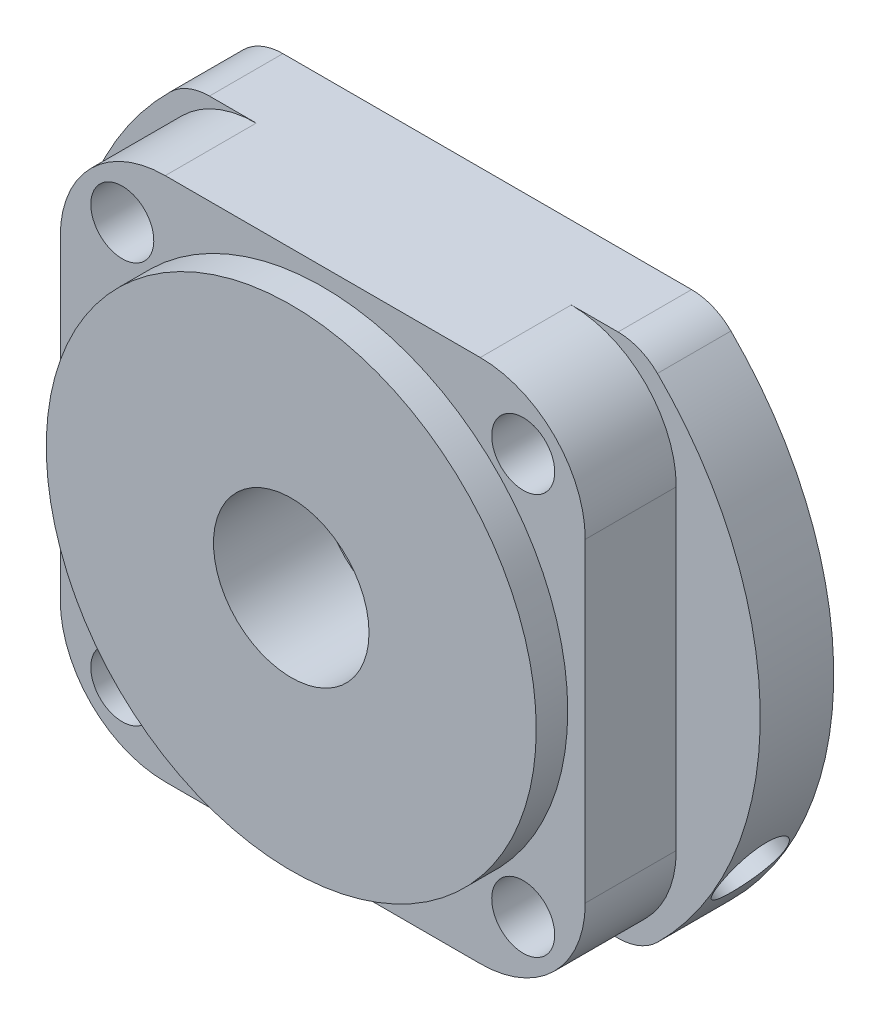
ISO-10303-21;
HEADER;
FILE_DESCRIPTION(('STEP AP214'),'2;1');
FILE_NAME('part.step','',(''),(''),'','','');
FILE_SCHEMA(('AUTOMOTIVE_DESIGN { 1 0 10303 214 1 1 1 1 }'));
ENDSEC;
DATA;
#1=APPLICATION_CONTEXT('core data for automotive mechanical design processes');
#2=APPLICATION_PROTOCOL_DEFINITION('international standard','automotive_design',2000,#1);
#3=PRODUCT_CONTEXT('',#1,'mechanical');
#4=PRODUCT('Part','Part','',(#3));
#5=PRODUCT_RELATED_PRODUCT_CATEGORY('part','',(#4));
#6=PRODUCT_DEFINITION_FORMATION('','',#4);
#7=PRODUCT_DEFINITION_CONTEXT('part definition',#1,'design');
#8=PRODUCT_DEFINITION('design','',#6,#7);
#9=PRODUCT_DEFINITION_SHAPE('','',#8);
#10=(LENGTH_UNIT() NAMED_UNIT(*) SI_UNIT(.MILLI.,.METRE.));
#11=(NAMED_UNIT(*) PLANE_ANGLE_UNIT() SI_UNIT($,.RADIAN.));
#12=(NAMED_UNIT(*) SI_UNIT($,.STERADIAN.) SOLID_ANGLE_UNIT());
#13=UNCERTAINTY_MEASURE_WITH_UNIT(LENGTH_MEASURE(1.E-05),#10,'distance_accuracy_value','');
#14=(GEOMETRIC_REPRESENTATION_CONTEXT(3) GLOBAL_UNCERTAINTY_ASSIGNED_CONTEXT((#13)) GLOBAL_UNIT_ASSIGNED_CONTEXT((#10,
#11,#12)) REPRESENTATION_CONTEXT('',''));
#15=CARTESIAN_POINT('',(0.,0.,0.));
#16=DIRECTION('',(0.,0.,1.));
#17=DIRECTION('',(1.,0.,0.));
#18=AXIS2_PLACEMENT_3D('',#15,#16,#17);
#19=CARTESIAN_POINT('',(0.,0.,21.));
#20=DIRECTION('',(0.,0.,-1.));
#21=DIRECTION('',(-1.,0.,0.));
#22=AXIS2_PLACEMENT_3D('',#19,#20,#21);
#23=CYLINDRICAL_SURFACE('',#22,99.);
#24=CARTESIAN_POINT('',(0.,0.,0.));
#25=DIRECTION('',(0.,0.,1.));
#26=DIRECTION('',(1.,0.,0.));
#27=AXIS2_PLACEMENT_3D('',#24,#25,#26);
#28=CIRCLE('',#27,99.);
#29=CARTESIAN_POINT('',(69.6316834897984,-70.3734939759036,0.));
#30=VERTEX_POINT('',#29);
#31=CARTESIAN_POINT('',(69.6316834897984,70.3734939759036,0.));
#32=VERTEX_POINT('',#31);
#33=EDGE_CURVE('E215',#30,#32,#28,.T.);
#34=ORIENTED_EDGE('',*,*,#33,.T.);
#35=DIRECTION('',(0.,0.,-1.));
#36=VECTOR('',#35,1.);
#37=CARTESIAN_POINT('',(69.6316834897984,70.3734939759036,21.));
#38=LINE('',#37,#36);
#39=CARTESIAN_POINT('',(69.6316834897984,70.3734939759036,21.));
#40=VERTEX_POINT('',#39);
#41=EDGE_CURVE('E237',#32,#40,#38,.F.);
#42=ORIENTED_EDGE('',*,*,#41,.T.);
#43=CARTESIAN_POINT('',(0.,0.,21.));
#44=DIRECTION('',(0.,0.,1.));
#45=DIRECTION('',(1.,0.,0.));
#46=AXIS2_PLACEMENT_3D('',#43,#44,#45);
#47=CIRCLE('',#46,99.);
#48=CARTESIAN_POINT('',(69.6316834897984,-70.3734939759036,21.));
#49=VERTEX_POINT('',#48);
#50=EDGE_CURVE('E204',#49,#40,#47,.T.);
#51=ORIENTED_EDGE('',*,*,#50,.F.);
#52=DIRECTION('',(0.,0.,-1.));
#53=VECTOR('',#52,1.);
#54=CARTESIAN_POINT('',(69.6316834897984,-70.3734939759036,21.));
#55=LINE('',#54,#53);
#56=EDGE_CURVE('E234',#49,#30,#55,.T.);
#57=ORIENTED_EDGE('',*,*,#56,.T.);
#58=EDGE_LOOP('',(#34,#42,#51,#57));
#59=FACE_BOUND('',#58,.T.);
#60=CARTESIAN_POINT('',(80.298007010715,-57.9070813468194,10.5));
#61=CARTESIAN_POINT('',(80.2980049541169,-57.9070833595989,10.2198183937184));
#62=CARTESIAN_POINT('',(80.3049343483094,-57.8974788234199,9.93967902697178));
#63=CARTESIAN_POINT('',(80.3325772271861,-57.8591187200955,9.38130883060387));
#64=CARTESIAN_POINT('',(80.3532940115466,-57.8303585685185,9.10307847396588));
#65=CARTESIAN_POINT('',(80.4083262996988,-57.7538161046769,8.55033629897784));
#66=CARTESIAN_POINT('',(80.4426549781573,-57.7060153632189,8.27582835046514));
#67=CARTESIAN_POINT('',(80.5245518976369,-57.5916789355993,7.73274688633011));
#68=CARTESIAN_POINT('',(80.5721203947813,-57.525142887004,7.46417348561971));
#69=CARTESIAN_POINT('',(80.6799706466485,-57.3737828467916,6.93503817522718));
#70=CARTESIAN_POINT('',(80.740244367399,-57.2889704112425,6.67447132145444));
#71=CARTESIAN_POINT('',(80.8729095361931,-57.1015383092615,6.16300278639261));
#72=CARTESIAN_POINT('',(80.9453011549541,-56.9989183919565,5.91210124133));
#73=CARTESIAN_POINT('',(81.1014588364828,-56.7765076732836,5.42177787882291));
#74=CARTESIAN_POINT('',(81.1852224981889,-56.6567204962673,5.18235365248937));
#75=CARTESIAN_POINT('',(81.3633110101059,-56.4006731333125,4.71659914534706));
#76=CARTESIAN_POINT('',(81.4576359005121,-56.2644128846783,4.49026891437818));
#77=CARTESIAN_POINT('',(81.6562624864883,-55.9757588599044,4.05155706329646));
#78=CARTESIAN_POINT('',(81.7605960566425,-55.823313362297,3.83922390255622));
#79=CARTESIAN_POINT('',(81.9779820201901,-55.5035838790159,3.43081427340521));
#80=CARTESIAN_POINT('',(82.091034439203,-55.3362998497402,3.23473785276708));
#81=CARTESIAN_POINT('',(82.324808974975,-54.9879061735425,2.86020877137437));
#82=CARTESIAN_POINT('',(82.4455315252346,-54.8067957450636,2.68175710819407));
#83=CARTESIAN_POINT('',(82.6935342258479,-54.4318831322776,2.34375280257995));
#84=CARTESIAN_POINT('',(82.8208142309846,-54.2380812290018,2.18419974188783));
#85=CARTESIAN_POINT('',(83.0810772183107,-53.8385694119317,1.8847971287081));
#86=CARTESIAN_POINT('',(83.2140719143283,-53.6328347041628,1.74499083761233));
#87=CARTESIAN_POINT('',(83.4843400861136,-53.2111610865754,1.48649493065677));
#88=CARTESIAN_POINT('',(83.6216135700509,-52.9952221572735,1.36780535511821));
#89=CARTESIAN_POINT('',(83.8992608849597,-52.5545605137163,1.15240428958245));
#90=CARTESIAN_POINT('',(84.039634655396,-52.3298379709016,1.05569237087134));
#91=CARTESIAN_POINT('',(84.322314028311,-51.8731093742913,0.884949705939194));
#92=CARTESIAN_POINT('',(84.4646196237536,-51.64110334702,0.810918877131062));
#93=CARTESIAN_POINT('',(84.7495197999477,-51.1721984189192,0.686296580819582));
#94=CARTESIAN_POINT('',(84.8921117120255,-50.9353190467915,0.635625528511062));
#95=CARTESIAN_POINT('',(85.1769584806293,-50.4575375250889,0.557721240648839));
#96=CARTESIAN_POINT('',(85.3192133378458,-50.2166353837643,0.530487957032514));
#97=CARTESIAN_POINT('',(85.6023138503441,-49.7325094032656,0.499660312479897));
#98=CARTESIAN_POINT('',(85.7431595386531,-49.4892856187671,0.496065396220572));
#99=CARTESIAN_POINT('',(86.0224289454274,-49.0022501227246,0.512539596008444));
#100=CARTESIAN_POINT('',(86.160852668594,-48.758438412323,0.532608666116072));
#101=CARTESIAN_POINT('',(86.4338242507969,-48.2728838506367,0.596146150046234));
#102=CARTESIAN_POINT('',(86.5683844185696,-48.0311366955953,0.639528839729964));
#103=CARTESIAN_POINT('',(86.8332777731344,-47.5505746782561,0.749321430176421));
#104=CARTESIAN_POINT('',(86.9636109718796,-47.3117598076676,0.815731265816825));
#105=CARTESIAN_POINT('',(87.2192496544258,-46.8388167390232,0.971096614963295));
#106=CARTESIAN_POINT('',(87.3445550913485,-46.6046885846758,1.06005233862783));
#107=CARTESIAN_POINT('',(87.5894111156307,-46.1428583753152,1.25986779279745));
#108=CARTESIAN_POINT('',(87.7089616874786,-45.9151563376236,1.37072758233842));
#109=CARTESIAN_POINT('',(87.9418663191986,-45.4674821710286,1.61377529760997));
#110=CARTESIAN_POINT('',(88.0552089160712,-45.2475245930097,1.74600100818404));
#111=CARTESIAN_POINT('',(88.2748888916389,-44.8174331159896,2.03069720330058));
#112=CARTESIAN_POINT('',(88.3812262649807,-44.6072992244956,2.18316770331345));
#113=CARTESIAN_POINT('',(88.5863933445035,-44.1984528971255,2.50728013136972));
#114=CARTESIAN_POINT('',(88.6852228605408,-43.9997407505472,2.67892254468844));
#115=CARTESIAN_POINT('',(88.8749342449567,-43.6152728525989,3.04017063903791));
#116=CARTESIAN_POINT('',(88.9658160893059,-43.4295171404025,3.22977637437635));
#117=CARTESIAN_POINT('',(89.1396453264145,-43.0716077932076,3.62651155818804));
#118=CARTESIAN_POINT('',(89.2225554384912,-42.8995186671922,3.83371554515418));
#119=CARTESIAN_POINT('',(89.3796568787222,-42.5712351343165,4.2634541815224));
#120=CARTESIAN_POINT('',(89.4538481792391,-42.4150407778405,4.48598887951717));
#121=CARTESIAN_POINT('',(89.5932422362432,-42.1198006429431,4.94482525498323));
#122=CARTESIAN_POINT('',(89.6584449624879,-41.980754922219,5.18112697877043));
#123=CARTESIAN_POINT('',(89.7796380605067,-41.7209437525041,5.66583278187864));
#124=CARTESIAN_POINT('',(89.835628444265,-41.6001782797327,5.91423684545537));
#125=CARTESIAN_POINT('',(89.9382264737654,-41.3778976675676,6.4214496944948));
#126=CARTESIAN_POINT('',(89.9848320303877,-41.2763868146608,6.68026078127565));
#127=CARTESIAN_POINT('',(90.0685000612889,-41.0934960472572,7.20639937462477));
#128=CARTESIAN_POINT('',(90.105562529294,-41.0121161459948,7.47372688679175));
#129=CARTESIAN_POINT('',(90.1700325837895,-40.8701762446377,8.01498501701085));
#130=CARTESIAN_POINT('',(90.1974404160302,-40.809615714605,8.28891546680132));
#131=CARTESIAN_POINT('',(90.2425226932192,-40.7098280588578,8.84142344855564));
#132=CARTESIAN_POINT('',(90.2601971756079,-40.6706008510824,9.12000096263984));
#133=CARTESIAN_POINT('',(90.2857060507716,-40.6139415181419,9.67856467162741));
#134=CARTESIAN_POINT('',(90.2935835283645,-40.5964139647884,9.95853922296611));
#135=CARTESIAN_POINT('',(90.2996190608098,-40.582987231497,10.519110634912));
#136=CARTESIAN_POINT('',(90.2977771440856,-40.5870879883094,10.7997074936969));
#137=CARTESIAN_POINT('',(90.2843791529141,-40.6168825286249,11.3595154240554));
#138=CARTESIAN_POINT('',(90.2728232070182,-40.6425760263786,11.6387265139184));
#139=CARTESIAN_POINT('',(90.2400297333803,-40.7153364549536,12.1937744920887));
#140=CARTESIAN_POINT('',(90.2187922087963,-40.7624033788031,12.4696113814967));
#141=CARTESIAN_POINT('',(90.1667521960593,-40.877386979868,13.0153591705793));
#142=CARTESIAN_POINT('',(90.1359704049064,-40.9452585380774,13.2852815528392));
#143=CARTESIAN_POINT('',(90.0649164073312,-41.1013159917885,13.8179069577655));
#144=CARTESIAN_POINT('',(90.0246442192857,-41.1895018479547,14.0806099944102));
#145=CARTESIAN_POINT('',(89.9347290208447,-41.3854579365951,14.596956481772));
#146=CARTESIAN_POINT('',(89.885085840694,-41.4932285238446,14.8505997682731));
#147=CARTESIAN_POINT('',(89.7765835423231,-41.7274693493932,15.3470489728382));
#148=CARTESIAN_POINT('',(89.7177243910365,-41.8539396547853,15.5898548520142));
#149=CARTESIAN_POINT('',(89.5907619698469,-42.1250262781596,16.063760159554));
#150=CARTESIAN_POINT('',(89.5226272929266,-42.269704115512,16.2948159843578));
#151=CARTESIAN_POINT('',(89.3775080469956,-42.5756939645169,16.7426955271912));
#152=CARTESIAN_POINT('',(89.3005234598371,-42.7370060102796,16.9595192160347));
#153=CARTESIAN_POINT('',(89.1379870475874,-43.0749859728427,17.3774240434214));
#154=CARTESIAN_POINT('',(89.0524350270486,-43.2516542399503,17.5785048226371));
#155=CARTESIAN_POINT('',(88.8731031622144,-43.618955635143,17.9635114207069));
#156=CARTESIAN_POINT('',(88.7793233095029,-43.8095887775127,18.147437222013));
#157=CARTESIAN_POINT('',(88.5835725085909,-44.2040646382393,18.497486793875));
#158=CARTESIAN_POINT('',(88.4815726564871,-44.4079534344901,18.6635424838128));
#159=CARTESIAN_POINT('',(88.2701513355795,-44.8267262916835,18.9758908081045));
#160=CARTESIAN_POINT('',(88.1607298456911,-45.0416103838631,19.1221833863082));
#161=CARTESIAN_POINT('',(87.9350049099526,-45.4807194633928,19.3939562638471));
#162=CARTESIAN_POINT('',(87.8187015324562,-45.7049443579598,19.5194367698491));
#163=CARTESIAN_POINT('',(87.5798257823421,-46.1610265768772,19.7486811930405));
#164=CARTESIAN_POINT('',(87.457253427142,-46.3928838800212,19.8524451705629));
#165=CARTESIAN_POINT('',(87.2067598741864,-46.8620487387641,20.0373330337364));
#166=CARTESIAN_POINT('',(87.0788488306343,-47.0993455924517,20.1184978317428));
#167=CARTESIAN_POINT('',(86.8182357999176,-47.57802212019,20.2578448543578));
#168=CARTESIAN_POINT('',(86.6855338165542,-47.8194017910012,20.3160270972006));
#169=CARTESIAN_POINT('',(86.4161852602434,-48.3044498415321,20.408979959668));
#170=CARTESIAN_POINT('',(86.279538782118,-48.5481181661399,20.4437511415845));
#171=CARTESIAN_POINT('',(86.0032145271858,-49.0359630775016,20.4896270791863));
#172=CARTESIAN_POINT('',(85.8635367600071,-49.280139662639,20.5007319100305));
#173=CARTESIAN_POINT('',(85.5827604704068,-49.7661483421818,20.49919669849));
#174=CARTESIAN_POINT('',(85.4416710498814,-50.0079860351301,20.4866622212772));
#175=CARTESIAN_POINT('',(85.1584907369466,-50.4887044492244,20.4381483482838));
#176=CARTESIAN_POINT('',(85.0163998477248,-50.7275851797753,20.4021690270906));
#177=CARTESIAN_POINT('',(84.7322930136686,-51.2007291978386,20.3070290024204));
#178=CARTESIAN_POINT('',(84.5902770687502,-51.434992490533,20.2478683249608));
#179=CARTESIAN_POINT('',(84.3074334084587,-51.8973035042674,20.1067966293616));
#180=CARTESIAN_POINT('',(84.1666056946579,-52.1253512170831,20.0248855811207));
#181=CARTESIAN_POINT('',(83.8872982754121,-52.5736715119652,19.8389199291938));
#182=CARTESIAN_POINT('',(83.7488182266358,-52.7939452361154,19.734868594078));
#183=CARTESIAN_POINT('',(83.4753360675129,-53.2253087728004,19.5053625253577));
#184=CARTESIAN_POINT('',(83.3403339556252,-53.4363985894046,19.3799078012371));
#185=CARTESIAN_POINT('',(83.0749601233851,-53.8480359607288,19.1084898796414));
#186=CARTESIAN_POINT('',(82.9445883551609,-54.0485836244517,18.9625268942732));
#187=CARTESIAN_POINT('',(82.6896119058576,-54.4378749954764,18.6511227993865));
#188=CARTESIAN_POINT('',(82.5650072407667,-54.6266186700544,18.485681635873));
#189=CARTESIAN_POINT('',(82.3221600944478,-54.9919110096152,18.1357358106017));
#190=CARTESIAN_POINT('',(82.2039470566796,-55.1684041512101,17.9511527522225));
#191=CARTESIAN_POINT('',(81.9755457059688,-55.5072216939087,17.5648078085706));
#192=CARTESIAN_POINT('',(81.8653575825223,-55.6695457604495,17.3630455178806));
#193=CARTESIAN_POINT('',(81.6540200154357,-55.9790688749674,16.9437115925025));
#194=CARTESIAN_POINT('',(81.5528727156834,-56.1262643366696,16.7261362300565));
#195=CARTESIAN_POINT('',(81.3606189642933,-56.4045946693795,16.2767475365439));
#196=CARTESIAN_POINT('',(81.2695123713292,-56.5357297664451,16.0449344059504));
#197=CARTESIAN_POINT('',(81.0980067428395,-56.7814742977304,15.5680704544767));
#198=CARTESIAN_POINT('',(81.0176363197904,-56.8960396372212,15.3229866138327));
#199=CARTESIAN_POINT('',(80.86869251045,-57.1075416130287,14.8218791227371));
#200=CARTESIAN_POINT('',(80.8001188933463,-57.2044785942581,14.5658556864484));
#201=CARTESIAN_POINT('',(80.675528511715,-57.3800548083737,14.0449348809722));
#202=CARTESIAN_POINT('',(80.6194993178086,-57.4587121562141,13.7800465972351));
#203=CARTESIAN_POINT('',(80.5205040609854,-57.5973581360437,13.2431357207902));
#204=CARTESIAN_POINT('',(80.4775347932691,-57.6573513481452,12.9711148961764));
#205=CARTESIAN_POINT('',(80.393841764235,-57.7740162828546,12.3364510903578));
#206=CARTESIAN_POINT('',(80.3579548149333,-57.8238770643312,11.971887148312));
#207=CARTESIAN_POINT('',(80.3100388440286,-57.8904081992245,11.2381910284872));
#208=CARTESIAN_POINT('',(80.2980097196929,-57.90707869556,10.869058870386));
#209=CARTESIAN_POINT('',(80.298007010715,-57.9070813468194,10.5));
#210=B_SPLINE_CURVE_WITH_KNOTS('',3,(#60,#61,#62,#63,#64,#65,#66,#67,#68,#69,#70,#71,#72,#73,
#74,#75,#76,#77,#78,#79,#80,#81,#82,#83,#84,#85,#86,#87,#88,#89,#90,#91,#92,#93,#94,#95,#96,#97,
#98,#99,#100,#101,#102,#103,#104,#105,#106,#107,#108,#109,#110,#111,#112,#113,#114,#115,#116,
#117,#118,#119,#120,#121,#122,#123,#124,#125,#126,#127,#128,#129,#130,#131,#132,#133,#134,#135,
#136,#137,#138,#139,#140,#141,#142,#143,#144,#145,#146,#147,#148,#149,#150,#151,#152,#153,#154,
#155,#156,#157,#158,#159,#160,#161,#162,#163,#164,#165,#166,#167,#168,#169,#170,#171,#172,#173,
#174,#175,#176,#177,#178,#179,#180,#181,#182,#183,#184,#185,#186,#187,#188,#189,#190,#191,#192,
#193,#194,#195,#196,#197,#198,#199,#200,#201,#202,#203,#204,#205,#206,#207,#208,#209),
.UNSPECIFIED.,.T.,.F.,(4,2,2,2,2,2,2,2,2,2,2,2,2,2,2,2,2,2,2,2,2,2,2,2,2,2,2,2,2,2,2,2,2,2,2,2,
2,2,2,2,2,2,2,2,2,2,2,2,2,2,2,2,2,2,2,2,2,2,2,2,2,2,2,2,2,2,2,2,2,2,2,2,2,2,4),(0.,
0.840222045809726,1.68064525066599,2.52188387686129,3.36313877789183,4.20386331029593,
5.0445996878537,5.88515882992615,6.72572117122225,7.56905542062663,8.41239214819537,
9.25577658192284,10.0991423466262,10.9443280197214,11.7895153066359,12.6346861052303,
13.4798538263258,14.3221204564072,15.1643853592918,16.0066304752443,16.848873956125,
17.6880414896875,18.5272066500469,19.3663796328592,20.2055548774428,21.0462307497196,
21.8869072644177,22.7276050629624,23.5683054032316,24.4127634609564,25.2572241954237,
26.101687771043,26.9461502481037,27.7908005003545,28.6354513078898,29.4800806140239,
30.3247066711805,31.1656049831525,32.006500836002,32.8473855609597,33.6882700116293,
34.5273435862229,35.3664155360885,36.2055026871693,37.0445928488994,37.8865983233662,
38.728605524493,39.5706319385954,40.4126592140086,41.2577885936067,42.1029203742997,
42.9480437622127,43.7931648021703,44.6367457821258,45.480326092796,46.3238861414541,
47.1674435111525,48.0072427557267,48.8470393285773,49.6868349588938,50.5266317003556,
51.366304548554,52.2059770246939,53.0456408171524,53.8853069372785,54.7285590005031,
55.5718309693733,56.415302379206,57.2587619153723,58.1044262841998,58.9500741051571,
59.7948802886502,60.6394789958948,61.7462352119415,62.8529866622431),.UNSPECIFIED.);
#211=CARTESIAN_POINT('',(80.298007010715,-57.9070813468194,10.5));
#212=VERTEX_POINT('',#211);
#213=EDGE_CURVE('E44',#212,#212,#210,.T.);
#214=ORIENTED_EDGE('',*,*,#213,.F.);
#215=EDGE_LOOP('',(#214));
#216=FACE_BOUND('',#215,.T.);
#217=ADVANCED_FACE('F40',(#59,#216),#23,.T.);
#218=CARTESIAN_POINT('',(-45.,45.,47.));
#219=DIRECTION('',(0.,0.,1.));
#220=DIRECTION('',(1.,0.,0.));
#221=AXIS2_PLACEMENT_3D('',#218,#219,#220);
#222=PLANE('',#221);
#223=CARTESIAN_POINT('',(-57.2756492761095,57.2756492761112,47.));
#224=DIRECTION('',(0.,0.,1.));
#225=DIRECTION('',(0.,1.,0.));
#226=AXIS2_PLACEMENT_3D('',#223,#224,#225);
#227=CIRCLE('',#226,9.00000000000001);
#228=CARTESIAN_POINT('',(-57.2756492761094,66.2756492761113,47.));
#229=VERTEX_POINT('',#228);
#230=EDGE_CURVE('E408',#229,#229,#227,.T.);
#231=ORIENTED_EDGE('',*,*,#230,.F.);
#232=EDGE_LOOP('',(#231));
#233=FACE_BOUND('',#232,.T.);
#234=CARTESIAN_POINT('',(-57.275649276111,-57.2756492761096,47.));
#235=DIRECTION('',(0.,0.,1.));
#236=DIRECTION('',(-1.,0.,0.));
#237=AXIS2_PLACEMENT_3D('',#234,#235,#236);
#238=CIRCLE('',#237,9.00000000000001);
#239=CARTESIAN_POINT('',(-66.2756492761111,-57.2756492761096,47.));
#240=VERTEX_POINT('',#239);
#241=EDGE_CURVE('E402',#240,#240,#238,.T.);
#242=ORIENTED_EDGE('',*,*,#241,.F.);
#243=EDGE_LOOP('',(#242));
#244=FACE_BOUND('',#243,.T.);
#245=CARTESIAN_POINT('',(57.2756492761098,-57.2756492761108,47.));
#246=DIRECTION('',(0.,0.,1.));
#247=DIRECTION('',(0.,-1.,0.));
#248=AXIS2_PLACEMENT_3D('',#245,#246,#247);
#249=CIRCLE('',#248,9.00000000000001);
#250=CARTESIAN_POINT('',(57.2756492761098,-66.2756492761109,47.));
#251=VERTEX_POINT('',#250);
#252=EDGE_CURVE('E394',#251,#251,#249,.T.);
#253=ORIENTED_EDGE('',*,*,#252,.F.);
#254=EDGE_LOOP('',(#253));
#255=FACE_BOUND('',#254,.T.);
#256=CARTESIAN_POINT('',(57.2756492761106,57.2756492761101,47.));
#257=DIRECTION('',(0.,0.,1.));
#258=DIRECTION('',(1.,0.,0.));
#259=AXIS2_PLACEMENT_3D('',#256,#257,#258);
#260=CIRCLE('',#259,9.00000000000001);
#261=CARTESIAN_POINT('',(66.2756492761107,57.2756492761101,47.));
#262=VERTEX_POINT('',#261);
#263=EDGE_CURVE('E262',#262,#262,#260,.T.);
#264=ORIENTED_EDGE('',*,*,#263,.F.);
#265=EDGE_LOOP('',(#264));
#266=FACE_BOUND('',#265,.T.);
#267=CARTESIAN_POINT('',(-45.,45.,47.));
#268=DIRECTION('',(0.,0.,1.));
#269=DIRECTION('',(1.,0.,0.));
#270=AXIS2_PLACEMENT_3D('',#267,#268,#269);
#271=CIRCLE('',#270,30.);
#272=CARTESIAN_POINT('',(-45.,75.,47.));
#273=VERTEX_POINT('',#272);
#274=CARTESIAN_POINT('',(-75.,45.,47.));
#275=VERTEX_POINT('',#274);
#276=EDGE_CURVE('E168',#273,#275,#271,.T.);
#277=ORIENTED_EDGE('',*,*,#276,.T.);
#278=DIRECTION('',(0.,-1.,0.));
#279=VECTOR('',#278,1.);
#280=CARTESIAN_POINT('',(-75.,45.,47.));
#281=LINE('',#280,#279);
#282=CARTESIAN_POINT('',(-75.,-45.,47.));
#283=VERTEX_POINT('',#282);
#284=EDGE_CURVE('E158',#275,#283,#281,.T.);
#285=ORIENTED_EDGE('',*,*,#284,.T.);
#286=CARTESIAN_POINT('',(-45.,-45.,47.));
#287=DIRECTION('',(0.,0.,1.));
#288=DIRECTION('',(1.,0.,0.));
#289=AXIS2_PLACEMENT_3D('',#286,#287,#288);
#290=CIRCLE('',#289,30.);
#291=CARTESIAN_POINT('',(-45.,-75.,47.));
#292=VERTEX_POINT('',#291);
#293=EDGE_CURVE('E167',#283,#292,#290,.T.);
#294=ORIENTED_EDGE('',*,*,#293,.T.);
#295=DIRECTION('',(1.,0.,0.));
#296=VECTOR('',#295,1.);
#297=CARTESIAN_POINT('',(-45.,-75.,47.));
#298=LINE('',#297,#296);
#299=CARTESIAN_POINT('',(45.,-75.,47.));
#300=VERTEX_POINT('',#299);
#301=EDGE_CURVE('E267',#292,#300,#298,.T.);
#302=ORIENTED_EDGE('',*,*,#301,.T.);
#303=CARTESIAN_POINT('',(45.,-45.,47.));
#304=DIRECTION('',(0.,0.,1.));
#305=DIRECTION('',(1.,0.,0.));
#306=AXIS2_PLACEMENT_3D('',#303,#304,#305);
#307=CIRCLE('',#306,30.);
#308=CARTESIAN_POINT('',(75.,-45.,47.));
#309=VERTEX_POINT('',#308);
#310=EDGE_CURVE('E269',#300,#309,#307,.T.);
#311=ORIENTED_EDGE('',*,*,#310,.T.);
#312=DIRECTION('',(0.,1.,0.));
#313=VECTOR('',#312,1.);
#314=CARTESIAN_POINT('',(75.,45.,47.));
#315=LINE('',#314,#313);
#316=CARTESIAN_POINT('',(75.,45.,47.));
#317=VERTEX_POINT('',#316);
#318=EDGE_CURVE('E271',#309,#317,#315,.T.);
#319=ORIENTED_EDGE('',*,*,#318,.T.);
#320=CARTESIAN_POINT('',(45.,45.,47.));
#321=DIRECTION('',(0.,0.,1.));
#322=DIRECTION('',(-1.,0.,0.));
#323=AXIS2_PLACEMENT_3D('',#320,#321,#322);
#324=CIRCLE('',#323,30.);
#325=CARTESIAN_POINT('',(45.,75.,47.));
#326=VERTEX_POINT('',#325);
#327=EDGE_CURVE('E273',#317,#326,#324,.T.);
#328=ORIENTED_EDGE('',*,*,#327,.T.);
#329=DIRECTION('',(-1.,0.,0.));
#330=VECTOR('',#329,1.);
#331=CARTESIAN_POINT('',(-45.,75.,47.));
#332=LINE('',#331,#330);
#333=EDGE_CURVE('E174',#326,#273,#332,.T.);
#334=ORIENTED_EDGE('',*,*,#333,.T.);
#335=EDGE_LOOP('',(#277,#285,#294,#302,#311,#319,#328,#334));
#336=FACE_BOUND('',#335,.T.);
#337=CARTESIAN_POINT('',(0.,0.,47.));
#338=DIRECTION('',(0.,0.,1.));
#339=DIRECTION('',(1.,0.,0.));
#340=AXIS2_PLACEMENT_3D('',#337,#338,#339);
#341=CIRCLE('',#340,70.);
#342=CARTESIAN_POINT('',(70.,0.,47.));
#343=VERTEX_POINT('',#342);
#344=EDGE_CURVE('E178',#343,#343,#341,.F.);
#345=ORIENTED_EDGE('',*,*,#344,.T.);
#346=EDGE_LOOP('',(#345));
#347=FACE_BOUND('',#346,.T.);
#348=ADVANCED_FACE('F171',(#233,#244,#255,#266,#336,#347),#222,.T.);
#349=CARTESIAN_POINT('',(0.,0.,21.));
#350=DIRECTION('',(0.,0.,1.));
#351=DIRECTION('',(1.,0.,0.));
#352=AXIS2_PLACEMENT_3D('',#349,#350,#351);
#353=PLANE('',#352);
#354=DIRECTION('',(0.,1.,0.));
#355=VECTOR('',#354,1.);
#356=CARTESIAN_POINT('',(-75.,0.,21.));
#357=LINE('',#356,#355);
#358=CARTESIAN_POINT('',(-75.,-45.,21.));
#359=VERTEX_POINT('',#358);
#360=CARTESIAN_POINT('',(-75.,45.,21.));
#361=VERTEX_POINT('',#360);
#362=EDGE_CURVE('E61',#359,#361,#357,.T.);
#363=ORIENTED_EDGE('',*,*,#362,.T.);
#364=CARTESIAN_POINT('',(-45.,45.,21.));
#365=DIRECTION('',(0.,0.,1.));
#366=DIRECTION('',(1.,0.,0.));
#367=AXIS2_PLACEMENT_3D('',#364,#365,#366);
#368=CIRCLE('',#367,30.);
#369=CARTESIAN_POINT('',(-45.,75.,21.));
#370=VERTEX_POINT('',#369);
#371=EDGE_CURVE('E181',#361,#370,#368,.F.);
#372=ORIENTED_EDGE('',*,*,#371,.T.);
#373=DIRECTION('',(-1.,0.,0.));
#374=VECTOR('',#373,1.);
#375=CARTESIAN_POINT('',(-64.6219776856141,75.,21.));
#376=LINE('',#375,#374);
#377=CARTESIAN_POINT('',(-58.3780780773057,75.,21.));
#378=VERTEX_POINT('',#377);
#379=EDGE_CURVE('E207',#370,#378,#376,.T.);
#380=ORIENTED_EDGE('',*,*,#379,.T.);
#381=CARTESIAN_POINT('',(-58.3780780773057,59.,21.));
#382=DIRECTION('',(0.,0.,1.));
#383=DIRECTION('',(1.,0.,0.));
#384=AXIS2_PLACEMENT_3D('',#381,#382,#383);
#385=CIRCLE('',#384,16.);
#386=CARTESIAN_POINT('',(-69.6316834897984,70.3734939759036,21.));
#387=VERTEX_POINT('',#386);
#388=EDGE_CURVE('E243',#378,#387,#385,.T.);
#389=ORIENTED_EDGE('',*,*,#388,.T.);
#390=CARTESIAN_POINT('',(0.,0.,21.));
#391=DIRECTION('',(0.,0.,1.));
#392=DIRECTION('',(1.,0.,0.));
#393=AXIS2_PLACEMENT_3D('',#390,#391,#392);
#394=CIRCLE('',#393,99.);
#395=CARTESIAN_POINT('',(-69.6316834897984,-70.3734939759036,21.));
#396=VERTEX_POINT('',#395);
#397=EDGE_CURVE('E197',#387,#396,#394,.T.);
#398=ORIENTED_EDGE('',*,*,#397,.T.);
#399=CARTESIAN_POINT('',(-58.3780780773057,-59.,21.));
#400=DIRECTION('',(0.,0.,1.));
#401=DIRECTION('',(1.,0.,0.));
#402=AXIS2_PLACEMENT_3D('',#399,#400,#401);
#403=CIRCLE('',#402,16.);
#404=CARTESIAN_POINT('',(-58.3780780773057,-75.,21.));
#405=VERTEX_POINT('',#404);
#406=EDGE_CURVE('E239',#396,#405,#403,.T.);
#407=ORIENTED_EDGE('',*,*,#406,.T.);
#408=DIRECTION('',(1.,0.,0.));
#409=VECTOR('',#408,1.);
#410=CARTESIAN_POINT('',(-64.6219776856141,-75.,21.));
#411=LINE('',#410,#409);
#412=CARTESIAN_POINT('',(-45.,-75.,21.));
#413=VERTEX_POINT('',#412);
#414=EDGE_CURVE('E202',#405,#413,#411,.T.);
#415=ORIENTED_EDGE('',*,*,#414,.T.);
#416=CARTESIAN_POINT('',(-45.,-45.,21.));
#417=DIRECTION('',(0.,0.,1.));
#418=DIRECTION('',(1.,0.,0.));
#419=AXIS2_PLACEMENT_3D('',#416,#417,#418);
#420=CIRCLE('',#419,30.);
#421=EDGE_CURVE('E66',#413,#359,#420,.F.);
#422=ORIENTED_EDGE('',*,*,#421,.T.);
#423=EDGE_LOOP('',(#363,#372,#380,#389,#398,#407,#415,#422));
#424=FACE_BOUND('',#423,.T.);
#425=ADVANCED_FACE('F320',(#424),#353,.T.);
#426=DIRECTION('',(0.,-1.,0.));
#427=VECTOR('',#426,1.);
#428=CARTESIAN_POINT('',(75.,0.,21.));
#429=LINE('',#428,#427);
#430=CARTESIAN_POINT('',(75.,45.,21.));
#431=VERTEX_POINT('',#430);
#432=CARTESIAN_POINT('',(75.,-45.,21.));
#433=VERTEX_POINT('',#432);
#434=EDGE_CURVE('E184',#431,#433,#429,.T.);
#435=ORIENTED_EDGE('',*,*,#434,.T.);
#436=CARTESIAN_POINT('',(45.,-45.,21.));
#437=DIRECTION('',(0.,0.,1.));
#438=DIRECTION('',(1.,0.,0.));
#439=AXIS2_PLACEMENT_3D('',#436,#437,#438);
#440=CIRCLE('',#439,30.);
#441=CARTESIAN_POINT('',(45.,-75.,21.));
#442=VERTEX_POINT('',#441);
#443=EDGE_CURVE('E191',#433,#442,#440,.F.);
#444=ORIENTED_EDGE('',*,*,#443,.T.);
#445=CARTESIAN_POINT('',(58.3780780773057,-75.,21.));
#446=VERTEX_POINT('',#445);
#447=EDGE_CURVE('E200',#442,#446,#411,.T.);
#448=ORIENTED_EDGE('',*,*,#447,.T.);
#449=CARTESIAN_POINT('',(58.3780780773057,-59.,21.));
#450=DIRECTION('',(0.,0.,1.));
#451=DIRECTION('',(1.,0.,0.));
#452=AXIS2_PLACEMENT_3D('',#449,#450,#451);
#453=CIRCLE('',#452,16.);
#454=EDGE_CURVE('E241',#446,#49,#453,.T.);
#455=ORIENTED_EDGE('',*,*,#454,.T.);
#456=ORIENTED_EDGE('',*,*,#50,.T.);
#457=CARTESIAN_POINT('',(58.3780780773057,59.,21.));
#458=DIRECTION('',(0.,0.,1.));
#459=DIRECTION('',(1.,0.,0.));
#460=AXIS2_PLACEMENT_3D('',#457,#458,#459);
#461=CIRCLE('',#460,16.);
#462=CARTESIAN_POINT('',(58.3780780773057,75.,21.));
#463=VERTEX_POINT('',#462);
#464=EDGE_CURVE('E245',#40,#463,#461,.T.);
#465=ORIENTED_EDGE('',*,*,#464,.T.);
#466=CARTESIAN_POINT('',(45.,75.,21.));
#467=VERTEX_POINT('',#466);
#468=EDGE_CURVE('E208',#463,#467,#376,.T.);
#469=ORIENTED_EDGE('',*,*,#468,.T.);
#470=CARTESIAN_POINT('',(45.,45.,21.));
#471=DIRECTION('',(0.,0.,1.));
#472=DIRECTION('',(1.,0.,0.));
#473=AXIS2_PLACEMENT_3D('',#470,#471,#472);
#474=CIRCLE('',#473,30.);
#475=EDGE_CURVE('E182',#467,#431,#474,.F.);
#476=ORIENTED_EDGE('',*,*,#475,.T.);
#477=EDGE_LOOP('',(#435,#444,#448,#455,#456,#465,#469,#476));
#478=FACE_BOUND('',#477,.T.);
#479=ADVANCED_FACE('F322',(#478),#353,.T.);
#480=CARTESIAN_POINT('',(0.,0.,21.));
#481=DIRECTION('',(0.,0.,-1.));
#482=DIRECTION('',(-1.,0.,0.));
#483=AXIS2_PLACEMENT_3D('',#480,#481,#482);
#484=CYLINDRICAL_SURFACE('',#483,99.);
#485=ORIENTED_EDGE('',*,*,#397,.F.);
#486=DIRECTION('',(0.,0.,-1.));
#487=VECTOR('',#486,1.);
#488=CARTESIAN_POINT('',(-69.6316834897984,70.3734939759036,21.));
#489=LINE('',#488,#487);
#490=CARTESIAN_POINT('',(-69.6316834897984,70.3734939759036,0.));
#491=VERTEX_POINT('',#490);
#492=EDGE_CURVE('E249',#387,#491,#489,.T.);
#493=ORIENTED_EDGE('',*,*,#492,.T.);
#494=CARTESIAN_POINT('',(0.,0.,0.));
#495=DIRECTION('',(0.,0.,1.));
#496=DIRECTION('',(1.,0.,0.));
#497=AXIS2_PLACEMENT_3D('',#494,#495,#496);
#498=CIRCLE('',#497,99.);
#499=CARTESIAN_POINT('',(-69.6316834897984,-70.3734939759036,0.));
#500=VERTEX_POINT('',#499);
#501=EDGE_CURVE('E196',#491,#500,#498,.T.);
#502=ORIENTED_EDGE('',*,*,#501,.T.);
#503=DIRECTION('',(0.,0.,-1.));
#504=VECTOR('',#503,1.);
#505=CARTESIAN_POINT('',(-69.6316834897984,-70.3734939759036,21.));
#506=LINE('',#505,#504);
#507=EDGE_CURVE('E247',#500,#396,#506,.F.);
#508=ORIENTED_EDGE('',*,*,#507,.T.);
#509=EDGE_LOOP('',(#485,#493,#502,#508));
#510=FACE_BOUND('',#509,.T.);
#511=ADVANCED_FACE('F328',(#510),#484,.T.);
#512=CARTESIAN_POINT('',(-64.6219776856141,-75.,21.));
#513=DIRECTION('',(0.,1.,0.));
#514=DIRECTION('',(0.,0.,1.));
#515=AXIS2_PLACEMENT_3D('',#512,#513,#514);
#516=PLANE('',#515);
#517=DIRECTION('',(1.,0.,0.));
#518=VECTOR('',#517,1.);
#519=CARTESIAN_POINT('',(-64.6219776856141,-75.,0.));
#520=LINE('',#519,#518);
#521=CARTESIAN_POINT('',(-58.3780780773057,-75.,0.));
#522=VERTEX_POINT('',#521);
#523=CARTESIAN_POINT('',(58.3780780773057,-75.,0.));
#524=VERTEX_POINT('',#523);
#525=EDGE_CURVE('E213',#522,#524,#520,.T.);
#526=ORIENTED_EDGE('',*,*,#525,.T.);
#527=DIRECTION('',(0.,0.,-1.));
#528=VECTOR('',#527,1.);
#529=CARTESIAN_POINT('',(58.3780780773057,-75.,21.));
#530=LINE('',#529,#528);
#531=EDGE_CURVE('E11',#524,#446,#530,.F.);
#532=ORIENTED_EDGE('',*,*,#531,.T.);
#533=ORIENTED_EDGE('',*,*,#447,.F.);
#534=DIRECTION('',(0.,0.,-1.));
#535=VECTOR('',#534,1.);
#536=CARTESIAN_POINT('',(45.,-75.,47.));
#537=LINE('',#536,#535);
#538=EDGE_CURVE('E287',#300,#442,#537,.T.);
#539=ORIENTED_EDGE('',*,*,#538,.F.);
#540=ORIENTED_EDGE('',*,*,#301,.F.);
#541=DIRECTION('',(0.,0.,-1.));
#542=VECTOR('',#541,1.);
#543=CARTESIAN_POINT('',(-45.,-75.,47.));
#544=LINE('',#543,#542);
#545=EDGE_CURVE('E186',#292,#413,#544,.T.);
#546=ORIENTED_EDGE('',*,*,#545,.T.);
#547=ORIENTED_EDGE('',*,*,#414,.F.);
#548=DIRECTION('',(0.,0.,-1.));
#549=VECTOR('',#548,1.);
#550=CARTESIAN_POINT('',(-58.3780780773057,-75.,21.));
#551=LINE('',#550,#549);
#552=EDGE_CURVE('E53',#405,#522,#551,.T.);
#553=ORIENTED_EDGE('',*,*,#552,.T.);
#554=EDGE_LOOP('',(#526,#532,#533,#539,#540,#546,#547,#553));
#555=FACE_BOUND('',#554,.T.);
#556=ADVANCED_FACE('F294',(#555),#516,.F.);
#557=CARTESIAN_POINT('',(-64.6219776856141,75.,21.));
#558=DIRECTION('',(0.,-1.,0.));
#559=DIRECTION('',(0.,0.,-1.));
#560=AXIS2_PLACEMENT_3D('',#557,#558,#559);
#561=PLANE('',#560);
#562=DIRECTION('',(-1.,0.,0.));
#563=VECTOR('',#562,1.);
#564=CARTESIAN_POINT('',(-64.6219776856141,75.,0.));
#565=LINE('',#564,#563);
#566=CARTESIAN_POINT('',(58.3780780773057,75.,0.));
#567=VERTEX_POINT('',#566);
#568=CARTESIAN_POINT('',(-58.3780780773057,75.,0.));
#569=VERTEX_POINT('',#568);
#570=EDGE_CURVE('E201',#567,#569,#565,.T.);
#571=ORIENTED_EDGE('',*,*,#570,.T.);
#572=DIRECTION('',(0.,0.,-1.));
#573=VECTOR('',#572,1.);
#574=CARTESIAN_POINT('',(-58.3780780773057,75.,21.));
#575=LINE('',#574,#573);
#576=EDGE_CURVE('E210',#569,#378,#575,.F.);
#577=ORIENTED_EDGE('',*,*,#576,.T.);
#578=ORIENTED_EDGE('',*,*,#379,.F.);
#579=DIRECTION('',(0.,0.,-1.));
#580=VECTOR('',#579,1.);
#581=CARTESIAN_POINT('',(-45.,75.,47.));
#582=LINE('',#581,#580);
#583=EDGE_CURVE('E276',#273,#370,#582,.T.);
#584=ORIENTED_EDGE('',*,*,#583,.F.);
#585=ORIENTED_EDGE('',*,*,#333,.F.);
#586=DIRECTION('',(0.,0.,-1.));
#587=VECTOR('',#586,1.);
#588=CARTESIAN_POINT('',(45.,75.,47.));
#589=LINE('',#588,#587);
#590=EDGE_CURVE('E278',#326,#467,#589,.T.);
#591=ORIENTED_EDGE('',*,*,#590,.T.);
#592=ORIENTED_EDGE('',*,*,#468,.F.);
#593=DIRECTION('',(0.,0.,-1.));
#594=VECTOR('',#593,1.);
#595=CARTESIAN_POINT('',(58.3780780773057,75.,21.));
#596=LINE('',#595,#594);
#597=EDGE_CURVE('E221',#463,#567,#596,.T.);
#598=ORIENTED_EDGE('',*,*,#597,.T.);
#599=EDGE_LOOP('',(#571,#577,#578,#584,#585,#591,#592,#598));
#600=FACE_BOUND('',#599,.T.);
#601=ADVANCED_FACE('F317',(#600),#561,.F.);
#602=CARTESIAN_POINT('',(0.,0.,0.));
#603=DIRECTION('',(0.,0.,1.));
#604=DIRECTION('',(1.,0.,0.));
#605=AXIS2_PLACEMENT_3D('',#602,#603,#604);
#606=PLANE('',#605);
#607=CARTESIAN_POINT('',(0.,0.,0.));
#608=DIRECTION('',(0.,0.,-1.));
#609=DIRECTION('',(-1.,0.,0.));
#610=AXIS2_PLACEMENT_3D('',#607,#608,#609);
#611=CIRCLE('',#610,10.);
#612=CARTESIAN_POINT('',(-10.,0.,0.));
#613=VERTEX_POINT('',#612);
#614=EDGE_CURVE('E417',#613,#613,#611,.T.);
#615=ORIENTED_EDGE('',*,*,#614,.F.);
#616=EDGE_LOOP('',(#615));
#617=FACE_BOUND('',#616,.T.);
#618=CARTESIAN_POINT('',(-57.2756492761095,57.2756492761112,0.));
#619=DIRECTION('',(0.,0.,1.));
#620=DIRECTION('',(0.,1.,0.));
#621=AXIS2_PLACEMENT_3D('',#618,#619,#620);
#622=CIRCLE('',#621,9.00000000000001);
#623=CARTESIAN_POINT('',(-57.2756492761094,66.2756492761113,0.));
#624=VERTEX_POINT('',#623);
#625=EDGE_CURVE('E405',#624,#624,#622,.T.);
#626=ORIENTED_EDGE('',*,*,#625,.T.);
#627=EDGE_LOOP('',(#626));
#628=FACE_BOUND('',#627,.T.);
#629=CARTESIAN_POINT('',(-57.275649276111,-57.2756492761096,0.));
#630=DIRECTION('',(0.,0.,1.));
#631=DIRECTION('',(-1.,0.,0.));
#632=AXIS2_PLACEMENT_3D('',#629,#630,#631);
#633=CIRCLE('',#632,9.00000000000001);
#634=CARTESIAN_POINT('',(-66.2756492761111,-57.2756492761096,0.));
#635=VERTEX_POINT('',#634);
#636=EDGE_CURVE('E399',#635,#635,#633,.T.);
#637=ORIENTED_EDGE('',*,*,#636,.T.);
#638=EDGE_LOOP('',(#637));
#639=FACE_BOUND('',#638,.T.);
#640=CARTESIAN_POINT('',(57.2756492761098,-57.2756492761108,0.));
#641=DIRECTION('',(0.,0.,1.));
#642=DIRECTION('',(0.,-1.,0.));
#643=AXIS2_PLACEMENT_3D('',#640,#641,#642);
#644=CIRCLE('',#643,9.00000000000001);
#645=CARTESIAN_POINT('',(57.2756492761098,-66.2756492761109,0.));
#646=VERTEX_POINT('',#645);
#647=EDGE_CURVE('E392',#646,#646,#644,.T.);
#648=ORIENTED_EDGE('',*,*,#647,.T.);
#649=EDGE_LOOP('',(#648));
#650=FACE_BOUND('',#649,.T.);
#651=CARTESIAN_POINT('',(-58.3780780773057,59.,0.));
#652=DIRECTION('',(0.,0.,1.));
#653=DIRECTION('',(1.,0.,0.));
#654=AXIS2_PLACEMENT_3D('',#651,#652,#653);
#655=CIRCLE('',#654,16.);
#656=EDGE_CURVE('E229',#491,#569,#655,.F.);
#657=ORIENTED_EDGE('',*,*,#656,.T.);
#658=ORIENTED_EDGE('',*,*,#570,.F.);
#659=CARTESIAN_POINT('',(58.3780780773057,59.,0.));
#660=DIRECTION('',(0.,0.,1.));
#661=DIRECTION('',(1.,0.,0.));
#662=AXIS2_PLACEMENT_3D('',#659,#660,#661);
#663=CIRCLE('',#662,16.);
#664=EDGE_CURVE('E232',#567,#32,#663,.F.);
#665=ORIENTED_EDGE('',*,*,#664,.T.);
#666=ORIENTED_EDGE('',*,*,#33,.F.);
#667=CARTESIAN_POINT('',(58.3780780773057,-59.,0.));
#668=DIRECTION('',(0.,0.,1.));
#669=DIRECTION('',(1.,0.,0.));
#670=AXIS2_PLACEMENT_3D('',#667,#668,#669);
#671=CIRCLE('',#670,16.);
#672=EDGE_CURVE('E226',#30,#524,#671,.F.);
#673=ORIENTED_EDGE('',*,*,#672,.T.);
#674=ORIENTED_EDGE('',*,*,#525,.F.);
#675=CARTESIAN_POINT('',(-58.3780780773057,-59.,0.));
#676=DIRECTION('',(0.,0.,1.));
#677=DIRECTION('',(1.,0.,0.));
#678=AXIS2_PLACEMENT_3D('',#675,#676,#677);
#679=CIRCLE('',#678,16.);
#680=EDGE_CURVE('E224',#522,#500,#679,.F.);
#681=ORIENTED_EDGE('',*,*,#680,.T.);
#682=ORIENTED_EDGE('',*,*,#501,.F.);
#683=EDGE_LOOP('',(#657,#658,#665,#666,#673,#674,#681,#682));
#684=FACE_BOUND('',#683,.T.);
#685=CARTESIAN_POINT('',(57.2756492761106,57.2756492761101,0.));
#686=DIRECTION('',(0.,0.,1.));
#687=DIRECTION('',(1.,0.,0.));
#688=AXIS2_PLACEMENT_3D('',#685,#686,#687);
#689=CIRCLE('',#688,9.00000000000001);
#690=CARTESIAN_POINT('',(66.2756492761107,57.2756492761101,0.));
#691=VERTEX_POINT('',#690);
#692=EDGE_CURVE('E257',#691,#691,#689,.T.);
#693=ORIENTED_EDGE('',*,*,#692,.T.);
#694=EDGE_LOOP('',(#693));
#695=FACE_BOUND('',#694,.T.);
#696=ADVANCED_FACE('F351',(#617,#628,#639,#650,#684,#695),#606,.F.);
#697=CARTESIAN_POINT('',(58.3780780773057,59.,21.));
#698=DIRECTION('',(0.,0.,-1.));
#699=DIRECTION('',(-1.,0.,0.));
#700=AXIS2_PLACEMENT_3D('',#697,#698,#699);
#701=CYLINDRICAL_SURFACE('',#700,16.);
#702=ORIENTED_EDGE('',*,*,#464,.F.);
#703=ORIENTED_EDGE('',*,*,#41,.F.);
#704=ORIENTED_EDGE('',*,*,#664,.F.);
#705=ORIENTED_EDGE('',*,*,#597,.F.);
#706=EDGE_LOOP('',(#702,#703,#704,#705));
#707=FACE_BOUND('',#706,.T.);
#708=ADVANCED_FACE('F347',(#707),#701,.T.);
#709=CARTESIAN_POINT('',(-58.3780780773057,59.,21.));
#710=DIRECTION('',(0.,0.,-1.));
#711=DIRECTION('',(-1.,0.,0.));
#712=AXIS2_PLACEMENT_3D('',#709,#710,#711);
#713=CYLINDRICAL_SURFACE('',#712,16.);
#714=ORIENTED_EDGE('',*,*,#388,.F.);
#715=ORIENTED_EDGE('',*,*,#576,.F.);
#716=ORIENTED_EDGE('',*,*,#656,.F.);
#717=ORIENTED_EDGE('',*,*,#492,.F.);
#718=EDGE_LOOP('',(#714,#715,#716,#717));
#719=FACE_BOUND('',#718,.T.);
#720=ADVANCED_FACE('F350',(#719),#713,.T.);
#721=CARTESIAN_POINT('',(58.3780780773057,-59.,21.));
#722=DIRECTION('',(0.,0.,-1.));
#723=DIRECTION('',(-1.,0.,0.));
#724=AXIS2_PLACEMENT_3D('',#721,#722,#723);
#725=CYLINDRICAL_SURFACE('',#724,16.);
#726=ORIENTED_EDGE('',*,*,#454,.F.);
#727=ORIENTED_EDGE('',*,*,#531,.F.);
#728=ORIENTED_EDGE('',*,*,#672,.F.);
#729=ORIENTED_EDGE('',*,*,#56,.F.);
#730=EDGE_LOOP('',(#726,#727,#728,#729));
#731=FACE_BOUND('',#730,.T.);
#732=ADVANCED_FACE('F354',(#731),#725,.T.);
#733=CARTESIAN_POINT('',(-58.3780780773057,-59.,21.));
#734=DIRECTION('',(0.,0.,-1.));
#735=DIRECTION('',(-1.,0.,0.));
#736=AXIS2_PLACEMENT_3D('',#733,#734,#735);
#737=CYLINDRICAL_SURFACE('',#736,16.);
#738=ORIENTED_EDGE('',*,*,#406,.F.);
#739=ORIENTED_EDGE('',*,*,#507,.F.);
#740=ORIENTED_EDGE('',*,*,#680,.F.);
#741=ORIENTED_EDGE('',*,*,#552,.F.);
#742=EDGE_LOOP('',(#738,#739,#740,#741));
#743=FACE_BOUND('',#742,.T.);
#744=ADVANCED_FACE('F42',(#743),#737,.T.);
#745=CARTESIAN_POINT('',(-45.,45.,47.));
#746=DIRECTION('',(0.,0.,-1.));
#747=DIRECTION('',(-1.,0.,0.));
#748=AXIS2_PLACEMENT_3D('',#745,#746,#747);
#749=CYLINDRICAL_SURFACE('',#748,30.);
#750=ORIENTED_EDGE('',*,*,#371,.F.);
#751=DIRECTION('',(0.,0.,-1.));
#752=VECTOR('',#751,1.);
#753=CARTESIAN_POINT('',(-75.,45.,47.));
#754=LINE('',#753,#752);
#755=EDGE_CURVE('E162',#275,#361,#754,.T.);
#756=ORIENTED_EDGE('',*,*,#755,.F.);
#757=ORIENTED_EDGE('',*,*,#276,.F.);
#758=ORIENTED_EDGE('',*,*,#583,.T.);
#759=EDGE_LOOP('',(#750,#756,#757,#758));
#760=FACE_BOUND('',#759,.T.);
#761=ADVANCED_FACE('F180',(#760),#749,.T.);
#762=CARTESIAN_POINT('',(-75.,45.,47.));
#763=DIRECTION('',(1.,0.,0.));
#764=DIRECTION('',(0.,1.,0.));
#765=AXIS2_PLACEMENT_3D('',#762,#763,#764);
#766=PLANE('',#765);
#767=ORIENTED_EDGE('',*,*,#362,.F.);
#768=DIRECTION('',(0.,0.,-1.));
#769=VECTOR('',#768,1.);
#770=CARTESIAN_POINT('',(-75.,-45.,47.));
#771=LINE('',#770,#769);
#772=EDGE_CURVE('E164',#283,#359,#771,.T.);
#773=ORIENTED_EDGE('',*,*,#772,.F.);
#774=ORIENTED_EDGE('',*,*,#284,.F.);
#775=ORIENTED_EDGE('',*,*,#755,.T.);
#776=EDGE_LOOP('',(#767,#773,#774,#775));
#777=FACE_BOUND('',#776,.T.);
#778=ADVANCED_FACE('F160',(#777),#766,.F.);
#779=CARTESIAN_POINT('',(-45.,-45.,47.));
#780=DIRECTION('',(0.,0.,-1.));
#781=DIRECTION('',(-1.,0.,0.));
#782=AXIS2_PLACEMENT_3D('',#779,#780,#781);
#783=CYLINDRICAL_SURFACE('',#782,30.);
#784=ORIENTED_EDGE('',*,*,#421,.F.);
#785=ORIENTED_EDGE('',*,*,#545,.F.);
#786=ORIENTED_EDGE('',*,*,#293,.F.);
#787=ORIENTED_EDGE('',*,*,#772,.T.);
#788=EDGE_LOOP('',(#784,#785,#786,#787));
#789=FACE_BOUND('',#788,.T.);
#790=ADVANCED_FACE('F298',(#789),#783,.T.);
#791=CARTESIAN_POINT('',(45.,-45.,47.));
#792=DIRECTION('',(0.,0.,-1.));
#793=DIRECTION('',(-1.,0.,0.));
#794=AXIS2_PLACEMENT_3D('',#791,#792,#793);
#795=CYLINDRICAL_SURFACE('',#794,30.);
#796=ORIENTED_EDGE('',*,*,#443,.F.);
#797=DIRECTION('',(0.,0.,-1.));
#798=VECTOR('',#797,1.);
#799=CARTESIAN_POINT('',(75.,-45.,47.));
#800=LINE('',#799,#798);
#801=EDGE_CURVE('E284',#309,#433,#800,.T.);
#802=ORIENTED_EDGE('',*,*,#801,.F.);
#803=ORIENTED_EDGE('',*,*,#310,.F.);
#804=ORIENTED_EDGE('',*,*,#538,.T.);
#805=EDGE_LOOP('',(#796,#802,#803,#804));
#806=FACE_BOUND('',#805,.T.);
#807=ADVANCED_FACE('F304',(#806),#795,.T.);
#808=CARTESIAN_POINT('',(75.,45.,47.));
#809=DIRECTION('',(-1.,0.,0.));
#810=DIRECTION('',(0.,0.,1.));
#811=AXIS2_PLACEMENT_3D('',#808,#809,#810);
#812=PLANE('',#811);
#813=ORIENTED_EDGE('',*,*,#434,.F.);
#814=DIRECTION('',(0.,0.,-1.));
#815=VECTOR('',#814,1.);
#816=CARTESIAN_POINT('',(75.,45.,47.));
#817=LINE('',#816,#815);
#818=EDGE_CURVE('E281',#317,#431,#817,.T.);
#819=ORIENTED_EDGE('',*,*,#818,.F.);
#820=ORIENTED_EDGE('',*,*,#318,.F.);
#821=ORIENTED_EDGE('',*,*,#801,.T.);
#822=EDGE_LOOP('',(#813,#819,#820,#821));
#823=FACE_BOUND('',#822,.T.);
#824=ADVANCED_FACE('F309',(#823),#812,.F.);
#825=CARTESIAN_POINT('',(45.,45.,47.));
#826=DIRECTION('',(0.,0.,-1.));
#827=DIRECTION('',(-1.,0.,0.));
#828=AXIS2_PLACEMENT_3D('',#825,#826,#827);
#829=CYLINDRICAL_SURFACE('',#828,30.);
#830=ORIENTED_EDGE('',*,*,#475,.F.);
#831=ORIENTED_EDGE('',*,*,#590,.F.);
#832=ORIENTED_EDGE('',*,*,#327,.F.);
#833=ORIENTED_EDGE('',*,*,#818,.T.);
#834=EDGE_LOOP('',(#830,#831,#832,#833));
#835=FACE_BOUND('',#834,.T.);
#836=ADVANCED_FACE('F314',(#835),#829,.T.);
#837=CARTESIAN_POINT('',(0.,0.,56.));
#838=DIRECTION('',(0.,0.,-1.));
#839=DIRECTION('',(-1.,0.,0.));
#840=AXIS2_PLACEMENT_3D('',#837,#838,#839);
#841=CYLINDRICAL_SURFACE('',#840,70.);
#842=ORIENTED_EDGE('',*,*,#344,.F.);
#843=EDGE_LOOP('',(#842));
#844=FACE_BOUND('',#843,.T.);
#845=CARTESIAN_POINT('',(0.,0.,56.));
#846=DIRECTION('',(0.,0.,1.));
#847=DIRECTION('',(1.,0.,0.));
#848=AXIS2_PLACEMENT_3D('',#845,#846,#847);
#849=CIRCLE('',#848,70.);
#850=CARTESIAN_POINT('',(70.,0.,56.));
#851=VERTEX_POINT('',#850);
#852=EDGE_CURVE('E254',#851,#851,#849,.T.);
#853=ORIENTED_EDGE('',*,*,#852,.F.);
#854=EDGE_LOOP('',(#853));
#855=FACE_BOUND('',#854,.T.);
#856=ADVANCED_FACE('F439',(#844,#855),#841,.T.);
#857=CARTESIAN_POINT('',(0.,0.,56.));
#858=DIRECTION('',(0.,0.,1.));
#859=DIRECTION('',(1.,0.,0.));
#860=AXIS2_PLACEMENT_3D('',#857,#858,#859);
#861=PLANE('',#860);
#862=CARTESIAN_POINT('',(0.,0.,56.));
#863=DIRECTION('',(0.,0.,1.));
#864=DIRECTION('',(1.,0.,0.));
#865=AXIS2_PLACEMENT_3D('',#862,#863,#864);
#866=CIRCLE('',#865,22.22);
#867=CARTESIAN_POINT('',(22.22,0.,56.));
#868=VERTEX_POINT('',#867);
#869=EDGE_CURVE('E423',#868,#868,#866,.T.);
#870=ORIENTED_EDGE('',*,*,#869,.F.);
#871=EDGE_LOOP('',(#870));
#872=FACE_BOUND('',#871,.T.);
#873=ORIENTED_EDGE('',*,*,#852,.T.);
#874=EDGE_LOOP('',(#873));
#875=FACE_BOUND('',#874,.T.);
#876=ADVANCED_FACE('F387',(#872,#875),#861,.T.);
#877=CARTESIAN_POINT('',(57.2756492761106,57.2756492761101,0.));
#878=DIRECTION('',(0.,0.,1.));
#879=DIRECTION('',(1.,0.,0.));
#880=AXIS2_PLACEMENT_3D('',#877,#878,#879);
#881=CYLINDRICAL_SURFACE('',#880,9.00000000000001);
#882=ORIENTED_EDGE('',*,*,#692,.F.);
#883=EDGE_LOOP('',(#882));
#884=FACE_BOUND('',#883,.T.);
#885=ORIENTED_EDGE('',*,*,#263,.T.);
#886=EDGE_LOOP('',(#885));
#887=FACE_BOUND('',#886,.T.);
#888=ADVANCED_FACE('F383',(#884,#887),#881,.F.);
#889=CARTESIAN_POINT('',(57.2756492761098,-57.2756492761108,0.));
#890=DIRECTION('',(0.,0.,1.));
#891=DIRECTION('',(1.,0.,0.));
#892=AXIS2_PLACEMENT_3D('',#889,#890,#891);
#893=CYLINDRICAL_SURFACE('',#892,9.00000000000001);
#894=ORIENTED_EDGE('',*,*,#647,.F.);
#895=EDGE_LOOP('',(#894));
#896=FACE_BOUND('',#895,.T.);
#897=ORIENTED_EDGE('',*,*,#252,.T.);
#898=EDGE_LOOP('',(#897));
#899=FACE_BOUND('',#898,.T.);
#900=ADVANCED_FACE('F386',(#896,#899),#893,.F.);
#901=CARTESIAN_POINT('',(-57.275649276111,-57.2756492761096,0.));
#902=DIRECTION('',(0.,0.,1.));
#903=DIRECTION('',(1.,0.,0.));
#904=AXIS2_PLACEMENT_3D('',#901,#902,#903);
#905=CYLINDRICAL_SURFACE('',#904,9.00000000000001);
#906=ORIENTED_EDGE('',*,*,#636,.F.);
#907=EDGE_LOOP('',(#906));
#908=FACE_BOUND('',#907,.T.);
#909=ORIENTED_EDGE('',*,*,#241,.T.);
#910=EDGE_LOOP('',(#909));
#911=FACE_BOUND('',#910,.T.);
#912=ADVANCED_FACE('F553',(#908,#911),#905,.F.);
#913=CARTESIAN_POINT('',(-57.2756492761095,57.2756492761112,0.));
#914=DIRECTION('',(0.,0.,1.));
#915=DIRECTION('',(1.,0.,0.));
#916=AXIS2_PLACEMENT_3D('',#913,#914,#915);
#917=CYLINDRICAL_SURFACE('',#916,9.00000000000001);
#918=ORIENTED_EDGE('',*,*,#625,.F.);
#919=EDGE_LOOP('',(#918));
#920=FACE_BOUND('',#919,.T.);
#921=ORIENTED_EDGE('',*,*,#230,.T.);
#922=EDGE_LOOP('',(#921));
#923=FACE_BOUND('',#922,.T.);
#924=ADVANCED_FACE('F549',(#920,#923),#917,.F.);
#925=CARTESIAN_POINT('',(126.439708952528,-73.0000000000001,10.5));
#926=DIRECTION('',(-0.866025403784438,0.500000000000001,0.));
#927=DIRECTION('',(-0.500000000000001,-0.866025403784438,0.));
#928=AXIS2_PLACEMENT_3D('',#925,#926,#927);
#929=CYLINDRICAL_SURFACE('',#928,10.);
#930=CARTESIAN_POINT('',(77.9422863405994,-45.0000000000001,10.5));
#931=DIRECTION('',(0.866025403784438,-0.500000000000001,0.));
#932=DIRECTION('',(0.500000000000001,0.866025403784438,0.));
#933=AXIS2_PLACEMENT_3D('',#930,#931,#932);
#934=CIRCLE('',#933,10.);
#935=CARTESIAN_POINT('',(82.9422863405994,-36.3397459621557,10.5));
#936=VERTEX_POINT('',#935);
#937=EDGE_CURVE('E413',#936,#936,#934,.T.);
#938=ORIENTED_EDGE('',*,*,#937,.F.);
#939=EDGE_LOOP('',(#938));
#940=FACE_BOUND('',#939,.T.);
#941=ORIENTED_EDGE('',*,*,#213,.T.);
#942=EDGE_LOOP('',(#941));
#943=FACE_BOUND('',#942,.T.);
#944=ADVANCED_FACE('F522',(#940,#943),#929,.F.);
#945=CARTESIAN_POINT('',(77.9422863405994,-45.0000000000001,10.5));
#946=DIRECTION('',(0.866025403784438,-0.500000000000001,0.));
#947=DIRECTION('',(0.500000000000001,0.866025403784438,0.));
#948=AXIS2_PLACEMENT_3D('',#945,#946,#947);
#949=PLANE('',#948);
#950=ORIENTED_EDGE('',*,*,#937,.T.);
#951=EDGE_LOOP('',(#950));
#952=FACE_BOUND('',#951,.T.);
#953=ADVANCED_FACE('F518',(#952),#949,.T.);
#954=CARTESIAN_POINT('',(0.,0.,6.));
#955=DIRECTION('',(0.,0.,-1.));
#956=DIRECTION('',(-1.,0.,0.));
#957=AXIS2_PLACEMENT_3D('',#954,#955,#956);
#958=CYLINDRICAL_SURFACE('',#957,10.);
#959=CARTESIAN_POINT('',(0.,0.,6.));
#960=DIRECTION('',(0.,0.,-1.));
#961=DIRECTION('',(-1.,0.,0.));
#962=AXIS2_PLACEMENT_3D('',#959,#960,#961);
#963=CIRCLE('',#962,10.);
#964=CARTESIAN_POINT('',(-10.,0.,6.));
#965=VERTEX_POINT('',#964);
#966=EDGE_CURVE('E416',#965,#965,#963,.T.);
#967=ORIENTED_EDGE('',*,*,#966,.F.);
#968=EDGE_LOOP('',(#967));
#969=FACE_BOUND('',#968,.T.);
#970=ORIENTED_EDGE('',*,*,#614,.T.);
#971=EDGE_LOOP('',(#970));
#972=FACE_BOUND('',#971,.T.);
#973=ADVANCED_FACE('F501',(#969,#972),#958,.F.);
#974=CARTESIAN_POINT('',(0.,0.,6.));
#975=DIRECTION('',(0.,0.,-1.));
#976=DIRECTION('',(-1.,0.,0.));
#977=AXIS2_PLACEMENT_3D('',#974,#975,#976);
#978=PLANE('',#977);
#979=ORIENTED_EDGE('',*,*,#966,.T.);
#980=EDGE_LOOP('',(#979));
#981=FACE_BOUND('',#980,.T.);
#982=ADVANCED_FACE('F434',(#981),#978,.T.);
#983=CARTESIAN_POINT('',(0.,0.,25.));
#984=DIRECTION('',(0.,0.,1.));
#985=DIRECTION('',(1.,0.,0.));
#986=AXIS2_PLACEMENT_3D('',#983,#984,#985);
#987=CYLINDRICAL_SURFACE('',#986,22.22);
#988=CARTESIAN_POINT('',(0.,0.,25.));
#989=DIRECTION('',(0.,0.,1.));
#990=DIRECTION('',(1.,0.,0.));
#991=AXIS2_PLACEMENT_3D('',#988,#989,#990);
#992=CIRCLE('',#991,22.22);
#993=CARTESIAN_POINT('',(22.22,0.,25.));
#994=VERTEX_POINT('',#993);
#995=EDGE_CURVE('E420',#994,#994,#992,.T.);
#996=ORIENTED_EDGE('',*,*,#995,.F.);
#997=EDGE_LOOP('',(#996));
#998=FACE_BOUND('',#997,.T.);
#999=ORIENTED_EDGE('',*,*,#869,.T.);
#1000=EDGE_LOOP('',(#999));
#1001=FACE_BOUND('',#1000,.T.);
#1002=ADVANCED_FACE('F431',(#998,#1001),#987,.F.);
#1003=CARTESIAN_POINT('',(0.,0.,25.));
#1004=DIRECTION('',(0.,0.,1.));
#1005=DIRECTION('',(1.,0.,0.));
#1006=AXIS2_PLACEMENT_3D('',#1003,#1004,#1005);
#1007=PLANE('',#1006);
#1008=ORIENTED_EDGE('',*,*,#995,.T.);
#1009=EDGE_LOOP('',(#1008));
#1010=FACE_BOUND('',#1009,.T.);
#1011=ADVANCED_FACE('F429',(#1010),#1007,.T.);
#1012=CLOSED_SHELL('',(#217,#348,#425,#479,#511,#556,#601,#696,#708,#720,#732,#744,#761,#778,
#790,#807,#824,#836,#856,#876,#888,#900,#912,#924,#944,#953,#973,#982,#1002,#1011));
#1013=MANIFOLD_SOLID_BREP('B2',#1012);
#1014=ADVANCED_BREP_SHAPE_REPRESENTATION('',(#18,#1013),#14);
#1015=SHAPE_DEFINITION_REPRESENTATION(#9,#1014);
ENDSEC;
END-ISO-10303-21;
